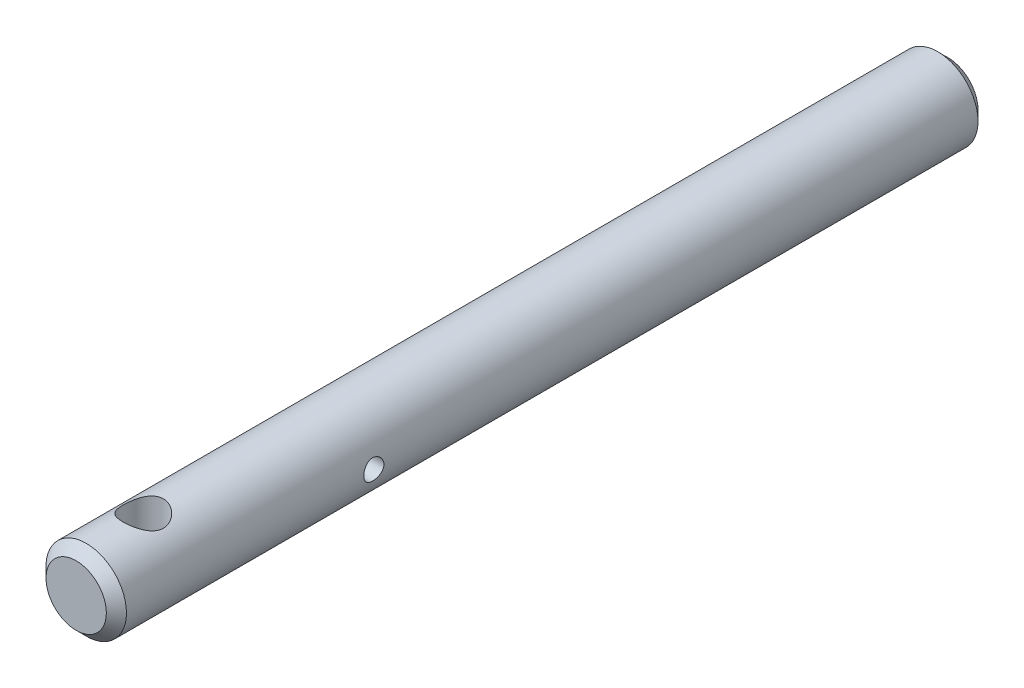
from build123d import *

# Parameters (mm, degrees)
ESQUISSE1_R             = 6
BASE_EXTRUSION_DEPTH    = 130
CHANFREIN1_SIZE         = 1.5
ESQUISSE4_R             = 3
ENL_V_MAT_EXTRU_1_DEPTH = 10
ESQUISSE6_R             = 1.5
ENL_V_MAT_EXTRU_2_DEPTH = 10


with BuildPart() as part:
    # Esquisse1 → Base-Extrusion (new body)
    with BuildSketch(Plane.XY):
        Circle(ESQUISSE1_R)
    extrude(amount=-BASE_EXTRUSION_DEPTH)

    # Chanfrein1
    chanfrein1_edges = [part.edges().sort_by_distance(p)[0] for p in [
        (-6, 0, 0),
        (-6, 0, -130),
    ]]
    chamfer(chanfrein1_edges, length=CHANFREIN1_SIZE)

    # Esquisse4 → Enl_v. mat.-Extru.1 (cut, symmetric)
    with BuildSketch(Plane(origin=(0, 0, 0), x_dir=(1, 0, 0), z_dir=(0, 1, 0))):
        with Locations(Location((0, 10, 0), (0, 0, 270))):
            Circle(ESQUISSE4_R)
    extrude(amount=ENL_V_MAT_EXTRU_1_DEPTH, both=True, mode=Mode.SUBTRACT)

    # Esquisse6 → Enl_v. mat.-Extru.2 (cut, symmetric)
    with BuildSketch(Plane(origin=(0, 0, 0), x_dir=(0, 0, -1), z_dir=(1, 0, 0))):
        with Locations((38.4, 0)):
            Circle(ESQUISSE6_R)
    extrude(amount=ENL_V_MAT_EXTRU_2_DEPTH, both=True, mode=Mode.SUBTRACT)


solid = part.part
